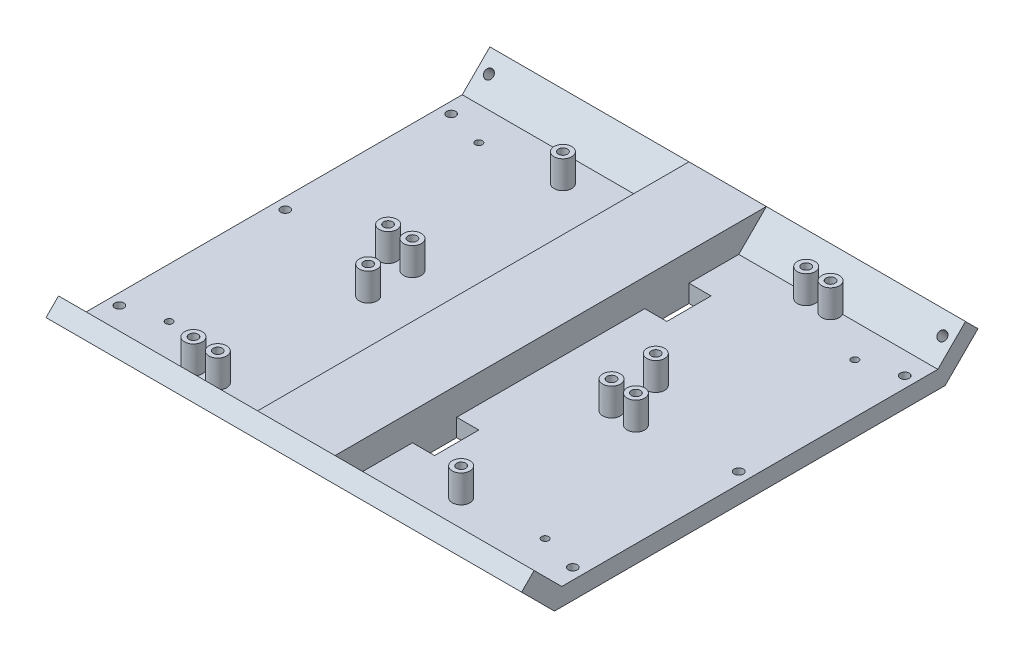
from build123d import *

# Parameters (mm, degrees)
MAIN_DEPTH                                   = 107.5
F_4_0MM_DOWEL_HOLE1_D                        = 4.1
F_4_0MM_DOWEL_HOLE1_ON_FACE_2_D              = 4.1
F_4_0MM_DOWEL_HOLE1_ON_FACE_3_D              = 4.1
F_4_0MM_DOWEL_HOLE1_ON_FACE_4_D              = 4.1
SKETCH4_W                                    = 10
SKETCH4_H                                    = 20
BATTERY_STRAP_CUTOUT_DEPTH                   = 150.511994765
BATTERY_STRAP_CUTOUT_MIRROR_AT_THE_S_2_W     = 10
BATTERY_STRAP_CUTOUT_MIRROR_AT_THE_S_2_H     = 20
BATTERY_STRAP_CUTOUT_MIRROR_AT_THE_S_3_DEPTH = 150.511994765
BATTERY_MOUNT_DEPTH                          = 17.5
PCB_MOUNTS_REACH                             = 152.392
SKETCH7_R                                    = 4
SKETCH8_R                                    = 2.05
PCB_MOUNT_INSERTS_DEPTH                      = 5.7
SKETCH9_R                                    = 1.6
FEET_SCREW_HOLE_DEPTH                        = 151.392275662
MIRROR1_AT_THE_SECOND_PLANE_COPY_1_SKETC_R   = 1.6
MIRROR1_AT_THE_SECOND_PLANE_COPY_1_DEPTH     = 151.392275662


with BuildPart() as part:
    # Sketch2 → Main (new, symmetric)
    with BuildSketch(Plane(origin=(0, 0, 0), x_dir=(0, 0, -1), z_dir=(1, 0, 0))):
        Polygon((-85, 0), (85, 0), (97.5, 12.5), (103.156854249, 6.843145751), (88.313708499, -8), (-88.313708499, -8), (-103.156854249, 6.843145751), (-97.5, 12.5), align=None)
    extrude(amount=MAIN_DEPTH, both=True)

    # 4.0mm Dowel Hole1 (through all)
    with Locations(Plane(origin=(-102.5, 7.071067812, -92.071067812), x_dir=(0, 0.707106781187, -0.707106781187), z_dir=(0, 0.707106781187, 0.707106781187))):
        with Locations((0, 0)):
            Hole(F_4_0MM_DOWEL_HOLE1_D / 2)

    # 4.0mm Dowel Hole1 on face 2 (through all)
    with Locations(Plane(origin=(-102.5, 0, -75), x_dir=(0, 0, 1), z_dir=(0, 1, 0))):
        with Locations((0, 0), (75, 0), (150, 0), (150, 205), (75, 205), (0, 205)):
            Hole(F_4_0MM_DOWEL_HOLE1_ON_FACE_2_D / 2)

    # 4.0mm Dowel Hole1 on face 3 (through all)
    with Locations(Plane(origin=(-102.5, 7.071067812, 92.071067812), x_dir=(0, -0.707106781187, -0.707106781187), z_dir=(0, 0.707106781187, -0.707106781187))):
        with Locations((0, 0), (0, -205)):
            Hole(F_4_0MM_DOWEL_HOLE1_ON_FACE_3_D / 2)

    # 4.0mm Dowel Hole1 on face 4 (through all)
    with Locations(Plane(origin=(102.5, 7.071067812, -92.071067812), x_dir=(0, 0.707106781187, -0.707106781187), z_dir=(0, 0.707106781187, 0.707106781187))):
        with Locations((0, 0)):
            Hole(F_4_0MM_DOWEL_HOLE1_ON_FACE_4_D / 2)

    # Sketch4 → Battery strap cutout (cut, through all)
    with BuildSketch(Plane(origin=(0, 0, 0), x_dir=(1, 0, 0), z_dir=(0, 1, 0))):
        with Locations((22.5, 52.5)):
            Rectangle(SKETCH4_W, SKETCH4_H)
    battery_strap_cutout = extrude(amount=-BATTERY_STRAP_CUTOUT_DEPTH, mode=Mode.SUBTRACT)

    # Battery strap cutout mirror: Battery strap cutout across plane
    add(battery_strap_cutout.mirror(Plane(origin=(0, 0, 0), x_dir=(0, 0, 1), z_dir=(1, 0, 0))), mode=Mode.SUBTRACT)

    # Battery strap cutout mirror at the secon: Battery strap cutout across plane
    add(battery_strap_cutout.mirror(Plane.XY), mode=Mode.SUBTRACT)

    # Battery strap cutout mirror at the s 2 → Battery strap cutout mirror at the s 3 (cut, through all)
    with BuildSketch(Plane(origin=(0, 0, 0), x_dir=(-1, 0, 0), z_dir=(0, 1, 0))):
        with Locations((22.5, 52.5)):
            Rectangle(BATTERY_STRAP_CUTOUT_MIRROR_AT_THE_S_2_W, BATTERY_STRAP_CUTOUT_MIRROR_AT_THE_S_2_H)
    extrude(amount=-BATTERY_STRAP_CUTOUT_MIRROR_AT_THE_S_3_DEPTH, mode=Mode.SUBTRACT)

    # Sketch6 → Battery mount (add, symmetric)
    with BuildSketch(Plane(origin=(0, 0, 0), x_dir=(0, 0, -1), z_dir=(1, 0, 0))):
        Polygon((-97.5, 12.5), (97.5, 12.5), (85, 0), (-85, 0), align=None)
    extrude(amount=BATTERY_MOUNT_DEPTH, both=True)

    # PCB mounts: up to this face of the body (flat: up to its plane)
    pcb_mounts_end = Plane(part.part.faces().sort_by_distance((63.47007498, 0, 0))[0])
    # Sketch7 → PCB mounts (add, up to the picked face)
    with BuildSketch(Plane(origin=(0, 12.5, 0), x_dir=(1, 0, 0), z_dir=(0, 1, 0)), mode=Mode.PRIVATE) as pcb_mounts_sk1:
        with Locations(Location((-50, -15, 0), (0, 0, 270))):
            Circle(SKETCH7_R)
    pcb_mounts_tool1 = split(extrude(pcb_mounts_sk1.sketch, amount=-PCB_MOUNTS_REACH, mode=Mode.PRIVATE), bisect_by=pcb_mounts_end, keep=Keep.BOTH, mode=Mode.PRIVATE)
    # Sketch7 → PCB mounts (add, up to the picked face)
    with BuildSketch(Plane(origin=(0, 12.5, 0), x_dir=(1, 0, 0), z_dir=(0, 1, 0)), mode=Mode.PRIVATE) as pcb_mounts_sk2:
        with Locations(Location((-50, -83, 0), (0, 0, 270))):
            Circle(SKETCH7_R)
    pcb_mounts_tool2 = split(extrude(pcb_mounts_sk2.sketch, amount=-PCB_MOUNTS_REACH, mode=Mode.PRIVATE), bisect_by=pcb_mounts_end, keep=Keep.BOTH, mode=Mode.PRIVATE)
    # Sketch7 → PCB mounts (add, up to the picked face)
    with BuildSketch(Plane(origin=(0, 12.5, 0), x_dir=(1, 0, 0), z_dir=(0, 1, 0)), mode=Mode.PRIVATE) as pcb_mounts_sk3:
        with Locations(Location((-61, -83, 0), (0, 0, 270))):
            Circle(SKETCH7_R)
    pcb_mounts_tool3 = split(extrude(pcb_mounts_sk3.sketch, amount=-PCB_MOUNTS_REACH, mode=Mode.PRIVATE), bisect_by=pcb_mounts_end, keep=Keep.BOTH, mode=Mode.PRIVATE)
    # Sketch7 → PCB mounts (add, up to the picked face)
    with BuildSketch(Plane(origin=(0, 12.5, 0), x_dir=(1, 0, 0), z_dir=(0, 1, 0)), mode=Mode.PRIVATE) as pcb_mounts_sk4:
        with Locations(Location((-50, 73, 0), (0, 0, 270))):
            Circle(SKETCH7_R)
    pcb_mounts_tool4 = split(extrude(pcb_mounts_sk4.sketch, amount=-PCB_MOUNTS_REACH, mode=Mode.PRIVATE), bisect_by=pcb_mounts_end, keep=Keep.BOTH, mode=Mode.PRIVATE)
    # Sketch7 → PCB mounts (add, up to the picked face)
    with BuildSketch(Plane(origin=(0, 12.5, 0), x_dir=(1, 0, 0), z_dir=(0, 1, 0)), mode=Mode.PRIVATE) as pcb_mounts_sk5:
        with Locations(Location((-50, 5, 0), (0, 0, 270))):
            Circle(SKETCH7_R)
    pcb_mounts_tool5 = split(extrude(pcb_mounts_sk5.sketch, amount=-PCB_MOUNTS_REACH, mode=Mode.PRIVATE), bisect_by=pcb_mounts_end, keep=Keep.BOTH, mode=Mode.PRIVATE)
    # Sketch7 → PCB mounts (add, up to the picked face)
    with BuildSketch(Plane(origin=(0, 12.5, 0), x_dir=(1, 0, 0), z_dir=(0, 1, 0)), mode=Mode.PRIVATE) as pcb_mounts_sk6:
        with Locations(Location((-61, 5, 0), (0, 0, 270))):
            Circle(SKETCH7_R)
    pcb_mounts_tool6 = split(extrude(pcb_mounts_sk6.sketch, amount=-PCB_MOUNTS_REACH, mode=Mode.PRIVATE), bisect_by=pcb_mounts_end, keep=Keep.BOTH, mode=Mode.PRIVATE)
    # Sketch7 → PCB mounts (add, up to the picked face)
    with BuildSketch(Plane(origin=(0, 12.5, 0), x_dir=(1, 0, 0), z_dir=(0, 1, 0)), mode=Mode.PRIVATE) as pcb_mounts_sk7:
        with Locations(Location((61, 83, 0), (0, 0, 270))):
            Circle(SKETCH7_R)
    pcb_mounts_tool7 = split(extrude(pcb_mounts_sk7.sketch, amount=-PCB_MOUNTS_REACH, mode=Mode.PRIVATE), bisect_by=pcb_mounts_end, keep=Keep.BOTH, mode=Mode.PRIVATE)
    # Sketch7 → PCB mounts (add, up to the picked face)
    with BuildSketch(Plane(origin=(0, 12.5, 0), x_dir=(1, 0, 0), z_dir=(0, 1, 0)), mode=Mode.PRIVATE) as pcb_mounts_sk8:
        with Locations(Location((50, 83, 0), (0, 0, 270))):
            Circle(SKETCH7_R)
    pcb_mounts_tool8 = split(extrude(pcb_mounts_sk8.sketch, amount=-PCB_MOUNTS_REACH, mode=Mode.PRIVATE), bisect_by=pcb_mounts_end, keep=Keep.BOTH, mode=Mode.PRIVATE)
    # Sketch7 → PCB mounts (add, up to the picked face)
    with BuildSketch(Plane(origin=(0, 12.5, 0), x_dir=(1, 0, 0), z_dir=(0, 1, 0)), mode=Mode.PRIVATE) as pcb_mounts_sk9:
        with Locations(Location((50, 15, 0), (0, 0, 270))):
            Circle(SKETCH7_R)
    pcb_mounts_tool9 = split(extrude(pcb_mounts_sk9.sketch, amount=-PCB_MOUNTS_REACH, mode=Mode.PRIVATE), bisect_by=pcb_mounts_end, keep=Keep.BOTH, mode=Mode.PRIVATE)
    # Sketch7 → PCB mounts (add, up to the picked face)
    with BuildSketch(Plane(origin=(0, 12.5, 0), x_dir=(1, 0, 0), z_dir=(0, 1, 0)), mode=Mode.PRIVATE) as pcb_mounts_sk10:
        with Locations(Location((61, -5, 0), (0, 0, 270))):
            Circle(SKETCH7_R)
    pcb_mounts_tool10 = split(extrude(pcb_mounts_sk10.sketch, amount=-PCB_MOUNTS_REACH, mode=Mode.PRIVATE), bisect_by=pcb_mounts_end, keep=Keep.BOTH, mode=Mode.PRIVATE)
    # Sketch7 → PCB mounts (add, up to the picked face)
    with BuildSketch(Plane(origin=(0, 12.5, 0), x_dir=(1, 0, 0), z_dir=(0, 1, 0)), mode=Mode.PRIVATE) as pcb_mounts_sk11:
        with Locations(Location((50, -5, 0), (0, 0, 270))):
            Circle(SKETCH7_R)
    pcb_mounts_tool11 = split(extrude(pcb_mounts_sk11.sketch, amount=-PCB_MOUNTS_REACH, mode=Mode.PRIVATE), bisect_by=pcb_mounts_end, keep=Keep.BOTH, mode=Mode.PRIVATE)
    # Sketch7 → PCB mounts (add, up to the picked face)
    with BuildSketch(Plane(origin=(0, 12.5, 0), x_dir=(1, 0, 0), z_dir=(0, 1, 0)), mode=Mode.PRIVATE) as pcb_mounts_sk12:
        with Locations(Location((50, -73, 0), (0, 0, 270))):
            Circle(SKETCH7_R)
    pcb_mounts_tool12 = split(extrude(pcb_mounts_sk12.sketch, amount=-PCB_MOUNTS_REACH, mode=Mode.PRIVATE), bisect_by=pcb_mounts_end, keep=Keep.BOTH, mode=Mode.PRIVATE)
    add(pcb_mounts_tool1.solids().sort_by(Axis((-50, 12.5, 15), (0, -1, 0)))[0])
    add(pcb_mounts_tool2.solids().sort_by(Axis((-50, 12.5, 83), (0, -1, 0)))[0])
    add(pcb_mounts_tool3.solids().sort_by(Axis((-61, 12.5, 83), (0, -1, 0)))[0])
    add(pcb_mounts_tool4.solids().sort_by(Axis((-50, 12.5, -73), (0, -1, 0)))[0])
    add(pcb_mounts_tool5.solids().sort_by(Axis((-50, 12.5, -5), (0, -1, 0)))[0])
    add(pcb_mounts_tool6.solids().sort_by(Axis((-61, 12.5, -5), (0, -1, 0)))[0])
    add(pcb_mounts_tool7.solids().sort_by(Axis((61, 12.5, -83), (0, -1, 0)))[0])
    add(pcb_mounts_tool8.solids().sort_by(Axis((50, 12.5, -83), (0, -1, 0)))[0])
    add(pcb_mounts_tool9.solids().sort_by(Axis((50, 12.5, -15), (0, -1, 0)))[0])
    add(pcb_mounts_tool10.solids().sort_by(Axis((61, 12.5, 5), (0, -1, 0)))[0])
    add(pcb_mounts_tool11.solids().sort_by(Axis((50, 12.5, 5), (0, -1, 0)))[0])
    add(pcb_mounts_tool12.solids().sort_by(Axis((50, 12.5, 73), (0, -1, 0)))[0])

    # Sketch8 → PCB mount inserts (cut)
    with BuildSketch(Plane(origin=(0, 12.5, 0), x_dir=(1, 0, 0), z_dir=(0, 1, 0))):
        with Locations(Location((-50, 73, 0), (0, 0, 270))):
            Circle(SKETCH8_R)
        with Locations(Location((-50, 5, 0), (0, 0, 270))):
            Circle(SKETCH8_R)
        with Locations(Location((-61, 5, 0), (0, 0, 270))):
            Circle(SKETCH8_R)
        with Locations(Location((-50, -15, 0), (0, 0, 270))):
            Circle(SKETCH8_R)
        with Locations(Location((-61, -83, 0), (0, 0, 270))):
            Circle(SKETCH8_R)
        with Locations(Location((-50, -83, 0), (0, 0, 270))):
            Circle(SKETCH8_R)
        with Locations(Location((50, -73, 0), (0, 0, 270))):
            Circle(SKETCH8_R)
        with Locations(Location((61, -5, 0), (0, 0, 270))):
            Circle(SKETCH8_R)
        with Locations(Location((50, -5, 0), (0, 0, 270))):
            Circle(SKETCH8_R)
        with Locations(Location((50, 15, 0), (0, 0, 270))):
            Circle(SKETCH8_R)
        with Locations(Location((61, 83, 0), (0, 0, 270))):
            Circle(SKETCH8_R)
        with Locations(Location((50, 83, 0), (0, 0, 270))):
            Circle(SKETCH8_R)
    extrude(amount=-PCB_MOUNT_INSERTS_DEPTH, mode=Mode.SUBTRACT)

    # Sketch9 → Feet screw hole (cut, through all)
    with BuildSketch(Plane.XZ.offset(8)):
        with Locations(Location((85, 70, 0), (0, 0, 270))):
            Circle(SKETCH9_R)
    feet_screw_hole = extrude(amount=-FEET_SCREW_HOLE_DEPTH, mode=Mode.SUBTRACT)

    # Mirror1: Feet screw hole across plane
    add(feet_screw_hole.mirror(Plane.XY), mode=Mode.SUBTRACT)

    # Mirror1 at the second plane: Feet screw hole across plane
    add(feet_screw_hole.mirror(Plane(origin=(0, 0, 0), x_dir=(0, 0, 1), z_dir=(1, 0, 0))), mode=Mode.SUBTRACT)

    # Mirror1 at the second plane copy 1 sketc → Mirror1 at the second plane copy 1 (cut, through all)
    with BuildSketch(Plane(origin=(0, -8, 0), x_dir=(-1, 0, 0), z_dir=(0, -1, 0))):
        with Locations(Location((85, 70, 0), (0, 0, 270))):
            Circle(MIRROR1_AT_THE_SECOND_PLANE_COPY_1_SKETC_R)
    extrude(amount=-MIRROR1_AT_THE_SECOND_PLANE_COPY_1_DEPTH, mode=Mode.SUBTRACT)


solid = part.part
